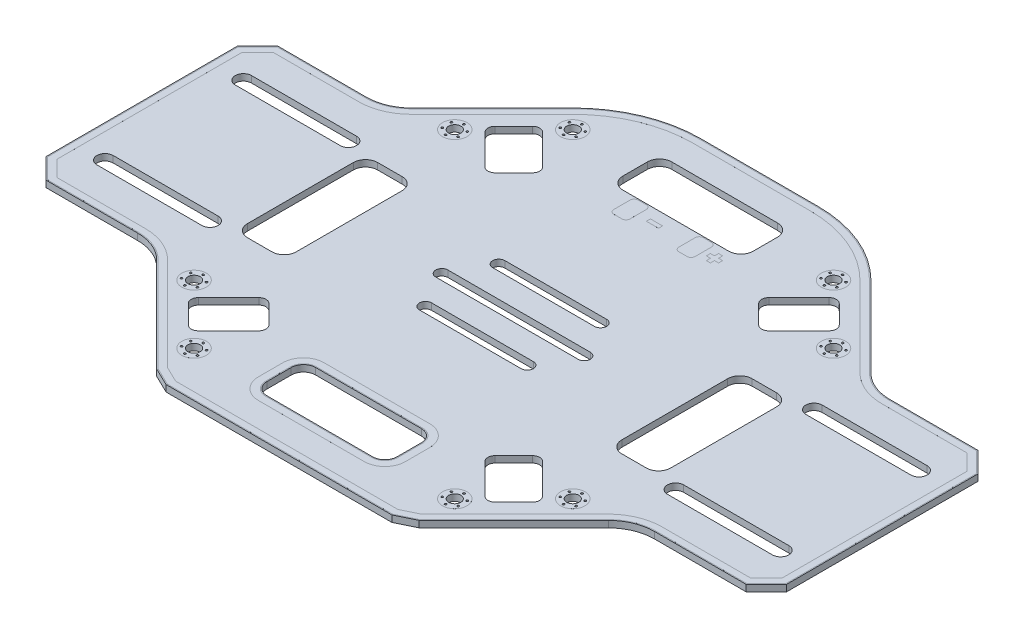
from build123d import *

# Parameters (mm, degrees)
BOSS_EXTRUDE1_DEPTH      = 0.8
BOSS_EXTRUDE1_DEPTH_BACK = 0.8
SKETCH1_R                = 1.5
SKETCH2_R                = 3
SKETCH2_R_2              = 0.25
SKETCH2_R_3              = 1.5
BOSS_EXTRUDE2_DEPTH      = 0.001
SKETCH6_R                = 0.25
CUT_EXTRUDE2_DEPTH       = 1.6
SKETCH7_W                = 3
SKETCH7_H                = 1
BOSS_EXTRUDE5_DEPTH      = 0.001


with BuildPart() as part:
    # Sketch1 → Boss-Extrude1 (new, two sides: drawn at the far end of the back side and taken through both)
    with BuildSketch(Plane(origin=(0, 0, 0), x_dir=(1, 0, 0), z_dir=(0, 1, 0)).offset(-BOSS_EXTRUDE1_DEPTH_BACK)):
        with BuildLine():
            Line((-27.75, -57.681401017), (27.75, -57.681401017))
            Line((27.75, -57.681401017), (32.25, -55.501951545))
            Line((32.25, -55.501951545), (55.501951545, -32.25))
            ThreePointArc((55.501951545, -32.25), (59.171487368, -29.798094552), (63.5, -28.937099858))
            Line((63.5, -28.937099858), (86, -28.937099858))
            Line((86, -28.937099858), (91, -23.937099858))
            Line((91, -23.937099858), (91, 23.062900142))
            Line((91, 23.062900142), (86, 28.062900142))
            Line((86, 28.062900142), (64.302117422, 28.062900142))
            ThreePointArc((64.302117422, 28.062900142), (60.040200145, 28.910648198), (56.427121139, 31.324830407))
            Line((56.427121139, 31.324830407), (36.628131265, 51.12382028))
            ThreePointArc((36.628131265, 51.12382028), (26.443529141, 57.928953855), (14.429971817, 60.318598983))
            Line((14.429971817, 60.318598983), (-14.429971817, 60.318598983))
            ThreePointArc((-14.429971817, 60.318598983), (-26.443529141, 57.928953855), (-36.628131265, 51.12382028))
            Line((-36.628131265, 51.12382028), (-56.427121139, 31.324830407))
            ThreePointArc((-56.427121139, 31.324830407), (-60.040200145, 28.910648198), (-64.302117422, 28.062900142))
            Line((-64.302117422, 28.062900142), (-86, 28.062900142))
            Line((-86, 28.062900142), (-91, 23.062900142))
            Line((-91, 23.062900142), (-91, -23.937099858))
            Line((-91, -23.937099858), (-86, -28.937099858))
            Line((-86, -28.937099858), (-63.5, -28.937099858))
            ThreePointArc((-63.5, -28.937099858), (-59.171487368, -29.798094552), (-55.501951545, -32.25))
            Line((-55.501951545, -32.25), (-32.25, -55.501951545))
            Line((-32.25, -55.501951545), (-27.75, -57.681401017))
        make_face()
        with Locations(Location((-32.031937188, 46.527626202, 0), (0, 0, 270))):
            Circle(SKETCH1_R, mode=Mode.SUBTRACT)
        with Locations(Location((-46.527626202, 32.031937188, 0), (0, 0, 270))):
            Circle(SKETCH1_R, mode=Mode.SUBTRACT)
        with Locations(Location((32.031937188, -46.527626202, 0), (0, 0, 270))):
            Circle(SKETCH1_R, mode=Mode.SUBTRACT)
        with Locations(Location((46.527626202, -32.031937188, 0), (0, 0, 270))):
            Circle(SKETCH1_R, mode=Mode.SUBTRACT)
        with Locations(Location((-46.527626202, -32.031937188, 0), (0, 0, 270))):
            Circle(SKETCH1_R, mode=Mode.SUBTRACT)
        with Locations(Location((-32.031937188, -46.527626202, 0), (0, 0, 270))):
            Circle(SKETCH1_R, mode=Mode.SUBTRACT)
        with Locations(Location((32.031937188, 46.527626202, 0), (0, 0, 270))):
            Circle(SKETCH1_R, mode=Mode.SUBTRACT)
        with Locations(Location((46.527626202, 32.031937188, 0), (0, 0, 270))):
            Circle(SKETCH1_R, mode=Mode.SUBTRACT)
        with BuildLine():
            Line((-13, -47.681401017), (13, -47.681401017))
            ThreePointArc((13, -47.681401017), (15.121320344, -46.802721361), (16, -44.681401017))
            Line((16, -44.681401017), (16, -38.681401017))
            ThreePointArc((16, -38.681401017), (15.121320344, -36.560080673), (13, -35.681401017))
            Line((13, -35.681401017), (-13, -35.681401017))
            ThreePointArc((-13, -35.681401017), (-15.121320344, -36.560080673), (-16, -38.681401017))
            Line((-16, -38.681401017), (-16, -44.681401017))
            ThreePointArc((-16, -44.681401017), (-15.121320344, -46.802721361), (-13, -47.681401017))
        make_face(mode=Mode.SUBTRACT)
        with BuildLine():
            Line((37.688791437, -42.284985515), (42.284985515, -37.688791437))
            ThreePointArc((42.284985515, -37.688791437), (42.797548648, -36.45135457), (42.284985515, -35.213917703))
            Line((42.284985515, -35.213917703), (34.860364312, -27.789296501))
            ThreePointArc((34.860364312, -27.789296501), (33.622927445, -27.276733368), (32.385490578, -27.789296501))
            Line((32.385490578, -27.789296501), (27.789296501, -32.385490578))
            ThreePointArc((27.789296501, -32.385490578), (27.276733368, -33.622927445), (27.789296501, -34.860364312))
            Line((27.789296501, -34.860364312), (35.213917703, -42.284985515))
            ThreePointArc((35.213917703, -42.284985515), (36.45135457, -42.797548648), (37.688791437, -42.284985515))
        make_face(mode=Mode.SUBTRACT)
        with BuildLine():
            Line((-35.213917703, -42.284985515), (-27.789296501, -34.860364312))
            ThreePointArc((-27.789296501, -34.860364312), (-27.276733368, -33.622927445), (-27.789296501, -32.385490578))
            Line((-27.789296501, -32.385490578), (-32.385490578, -27.789296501))
            ThreePointArc((-32.385490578, -27.789296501), (-33.622927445, -27.276733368), (-34.860364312, -27.789296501))
            Line((-34.860364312, -27.789296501), (-42.284985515, -35.213917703))
            ThreePointArc((-42.284985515, -35.213917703), (-42.797548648, -36.45135457), (-42.284985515, -37.688791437))
            Line((-42.284985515, -37.688791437), (-37.688791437, -42.284985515))
            ThreePointArc((-37.688791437, -42.284985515), (-36.45135457, -42.797548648), (-35.213917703, -42.284985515))
        make_face(mode=Mode.SUBTRACT)
        with BuildLine():
            Line((-35.213917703, 42.284985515), (-27.789296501, 34.860364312))
            ThreePointArc((-27.789296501, 34.860364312), (-27.276733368, 33.622927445), (-27.789296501, 32.385490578))
            Line((-27.789296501, 32.385490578), (-32.385490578, 27.789296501))
            ThreePointArc((-32.385490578, 27.789296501), (-33.622927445, 27.276733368), (-34.860364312, 27.789296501))
            Line((-34.860364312, 27.789296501), (-42.284985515, 35.213917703))
            ThreePointArc((-42.284985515, 35.213917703), (-42.797548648, 36.45135457), (-42.284985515, 37.688791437))
            Line((-42.284985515, 37.688791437), (-37.688791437, 42.284985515))
            ThreePointArc((-37.688791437, 42.284985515), (-36.45135457, 42.797548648), (-35.213917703, 42.284985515))
        make_face(mode=Mode.SUBTRACT)
        with BuildLine():
            Line((37.688791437, 42.284985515), (42.284985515, 37.688791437))
            ThreePointArc((42.284985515, 37.688791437), (42.797548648, 36.45135457), (42.284985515, 35.213917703))
            Line((42.284985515, 35.213917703), (34.860364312, 27.789296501))
            ThreePointArc((34.860364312, 27.789296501), (33.622927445, 27.276733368), (32.385490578, 27.789296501))
            Line((32.385490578, 27.789296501), (27.789296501, 32.385490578))
            ThreePointArc((27.789296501, 32.385490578), (27.276733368, 33.622927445), (27.789296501, 34.860364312))
            Line((27.789296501, 34.860364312), (35.213917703, 42.284985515))
            ThreePointArc((35.213917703, 42.284985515), (36.45135457, 42.797548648), (37.688791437, 42.284985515))
        make_face(mode=Mode.SUBTRACT)
        with BuildLine():
            Line((-13, 51.818598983), (13, 51.818598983))
            ThreePointArc((13, 51.818598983), (15.121320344, 50.939919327), (16, 48.818598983))
            Line((16, 48.818598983), (16, 42.818598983))
            ThreePointArc((16, 42.818598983), (15.121320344, 40.697278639), (13, 39.818598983))
            Line((13, 39.818598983), (-13, 39.818598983))
            ThreePointArc((-13, 39.818598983), (-15.121320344, 40.697278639), (-16, 42.818598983))
            Line((-16, 42.818598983), (-16, 48.818598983))
            ThreePointArc((-16, 48.818598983), (-15.121320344, 50.939919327), (-13, 51.818598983))
        make_face(mode=Mode.SUBTRACT)
        with BuildLine():
            Line((-12.5, -10.681401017), (12.5, -10.681401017))
            ThreePointArc((12.5, -10.681401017), (14, -9.181401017), (12.5, -7.681401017))
            Line((12.5, -7.681401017), (-12.5, -7.681401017))
            ThreePointArc((-12.5, -7.681401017), (-14, -9.181401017), (-12.5, -10.681401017))
        make_face(mode=Mode.SUBTRACT)
        with BuildLine():
            Line((-17.5, -1.681401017), (17.5, -1.681401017))
            ThreePointArc((17.5, -1.681401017), (19, -0.181401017), (17.5, 1.318598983))
            Line((17.5, 1.318598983), (-17.5, 1.318598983))
            ThreePointArc((-17.5, 1.318598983), (-19, -0.181401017), (-17.5, -1.681401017))
        make_face(mode=Mode.SUBTRACT)
        with BuildLine():
            Line((-12.5, 7.318598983), (12.5, 7.318598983))
            ThreePointArc((12.5, 7.318598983), (14, 8.818598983), (12.5, 10.318598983))
            Line((12.5, 10.318598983), (-12.5, 10.318598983))
            ThreePointArc((-12.5, 10.318598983), (-14, 8.818598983), (-12.5, 7.318598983))
        make_face(mode=Mode.SUBTRACT)
        with BuildLine():
            Line((-52, 12.562900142), (-52, -13.437099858))
            ThreePointArc((-52, -13.437099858), (-51.121320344, -15.558420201), (-49, -16.437099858))
            Line((-49, -16.437099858), (-43, -16.437099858))
            ThreePointArc((-43, -16.437099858), (-40.878679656, -15.558420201), (-40, -13.437099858))
            Line((-40, -13.437099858), (-40, 12.562900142))
            ThreePointArc((-40, 12.562900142), (-40.878679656, 14.684220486), (-43, 15.562900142))
            Line((-43, 15.562900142), (-49, 15.562900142))
            ThreePointArc((-49, 15.562900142), (-51.121320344, 14.684220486), (-52, 12.562900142))
        make_face(mode=Mode.SUBTRACT)
        with BuildLine():
            Line((52, 12.562900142), (52, -13.437099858))
            ThreePointArc((52, -13.437099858), (51.121320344, -15.558420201), (49, -16.437099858))
            Line((49, -16.437099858), (43, -16.437099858))
            ThreePointArc((43, -16.437099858), (40.878679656, -15.558420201), (40, -13.437099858))
            Line((40, -13.437099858), (40, 12.562900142))
            ThreePointArc((40, 12.562900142), (40.878679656, 14.684220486), (43, 15.562900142))
            Line((43, 15.562900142), (49, 15.562900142))
            ThreePointArc((49, 15.562900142), (51.121320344, 14.684220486), (52, 12.562900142))
        make_face(mode=Mode.SUBTRACT)
        with BuildLine():
            Line((-83, 18.562900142), (-57.2, 18.562900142))
            ThreePointArc((-57.2, 18.562900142), (-55.2, 16.562900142), (-57.2, 14.562900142))
            Line((-57.2, 14.562900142), (-83, 14.562900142))
            ThreePointArc((-83, 14.562900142), (-85, 16.562900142), (-83, 18.562900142))
        make_face(mode=Mode.SUBTRACT)
        with BuildLine():
            Line((-83, -15.437099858), (-57.2, -15.437099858))
            ThreePointArc((-57.2, -15.437099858), (-55.2, -17.437099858), (-57.2, -19.437099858))
            Line((-57.2, -19.437099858), (-83, -19.437099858))
            ThreePointArc((-83, -19.437099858), (-85, -17.437099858), (-83, -15.437099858))
        make_face(mode=Mode.SUBTRACT)
        with BuildLine():
            Line((57.2, -15.437099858), (83, -15.437099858))
            ThreePointArc((83, -15.437099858), (85, -17.437099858), (83, -19.437099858))
            Line((83, -19.437099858), (57.2, -19.437099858))
            ThreePointArc((57.2, -19.437099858), (55.2, -17.437099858), (57.2, -15.437099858))
        make_face(mode=Mode.SUBTRACT)
        with BuildLine():
            Line((57.2, 18.562900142), (83, 18.562900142))
            ThreePointArc((83, 18.562900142), (85, 16.562900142), (83, 14.562900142))
            Line((83, 14.562900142), (57.2, 14.562900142))
            ThreePointArc((57.2, 14.562900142), (55.2, 16.562900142), (57.2, 18.562900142))
        make_face(mode=Mode.SUBTRACT)
    extrude(amount=BOSS_EXTRUDE1_DEPTH + BOSS_EXTRUDE1_DEPTH_BACK)

    # Sketch2 → Boss-Extrude2 (add)
    # profile 1 of 10: a face of its own
    with BuildSketch(Plane(origin=(0, 0.8, 0), x_dir=(1, 0, 0), z_dir=(0, 1, 0))):
        with BuildLine():
            ThreePointArc((56.250344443, 31.148053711), (59.944529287, 28.679678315), (64.302117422, 27.812900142))
            Line((64.302117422, 27.812900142), (85.896446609, 27.812900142))
            Line((85.896446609, 27.812900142), (90.75, 22.959346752))
            Line((90.75, 22.959346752), (90.75, -23.833546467))
            Line((90.75, -23.833546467), (85.896446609, -28.687099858))
            Line((85.896446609, -28.687099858), (63.5, -28.687099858))
            ThreePointArc((63.5, -28.687099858), (59.075816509, -29.567124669), (55.32517485, -32.073223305))
            Line((55.32517485, -32.073223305), (32.10305631, -55.295341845))
            Line((32.10305631, -55.295341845), (27.692646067, -57.431401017))
            Line((27.692646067, -57.431401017), (-27.692646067, -57.431401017))
            Line((-27.692646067, -57.431401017), (-32.10305631, -55.295341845))
            Line((-32.10305631, -55.295341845), (-55.32517485, -32.073223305))
            ThreePointArc((-55.32517485, -32.073223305), (-59.075816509, -29.567124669), (-63.5, -28.687099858))
            Line((-63.5, -28.687099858), (-85.896446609, -28.687099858))
            Line((-85.896446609, -28.687099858), (-90.75, -23.833546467))
            Line((-90.75, -23.833546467), (-90.75, 22.959346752))
            Line((-90.75, 22.959346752), (-85.896446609, 27.812900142))
            Line((-85.896446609, 27.812900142), (-64.302117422, 27.812900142))
            ThreePointArc((-64.302117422, 27.812900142), (-59.944529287, 28.679678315), (-56.250344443, 31.148053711))
            Line((-56.250344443, 31.148053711), (-36.45135457, 50.947043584))
            ThreePointArc((-36.45135457, 50.947043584), (-26.347858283, 57.697983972), (-14.429971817, 60.068598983))
            Line((-14.429971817, 60.068598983), (14.429971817, 60.068598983))
            ThreePointArc((14.429971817, 60.068598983), (26.347858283, 57.697983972), (36.45135457, 50.947043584))
            Line((36.45135457, 50.947043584), (56.250344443, 31.148053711))
        make_face()
        with BuildLine():
            Line((-85.212994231, 26.162900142), (-64.302117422, 26.162900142))
            ThreePointArc((-64.302117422, 26.162900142), (-59.313101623, 27.155277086), (-55.083618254, 29.981327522))
            Line((-55.083618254, 29.981327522), (-35.284628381, 49.780317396))
            ThreePointArc((-35.284628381, 49.780317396), (-25.71643062, 56.173582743), (-14.429971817, 58.418598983))
            Line((-14.429971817, 58.418598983), (14.429971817, 58.418598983))
            ThreePointArc((14.429971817, 58.418598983), (25.71643062, 56.173582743), (35.284628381, 49.780317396))
            Line((35.284628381, 49.780317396), (55.083618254, 29.981327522))
            ThreePointArc((55.083618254, 29.981327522), (59.313101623, 27.155277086), (64.302117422, 26.162900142))
            Line((64.302117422, 26.162900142), (85.212994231, 26.162900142))
            Line((85.212994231, 26.162900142), (89.1, 22.275894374))
            Line((89.1, 22.275894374), (89.1, -23.150094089))
            Line((89.1, -23.150094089), (85.212994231, -27.037099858))
            Line((85.212994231, -27.037099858), (63.5, -27.037099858))
            ThreePointArc((63.5, -27.037099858), (58.444388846, -28.042723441), (54.158448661, -30.906497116))
            Line((54.158448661, -30.906497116), (31.133227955, -53.931717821))
            Line((31.133227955, -53.931717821), (27.314110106, -55.781401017))
            Line((27.314110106, -55.781401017), (-27.314110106, -55.781401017))
            Line((-27.314110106, -55.781401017), (-31.133227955, -53.931717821))
            Line((-31.133227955, -53.931717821), (-54.158448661, -30.906497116))
            ThreePointArc((-54.158448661, -30.906497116), (-58.444388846, -28.042723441), (-63.5, -27.037099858))
            Line((-63.5, -27.037099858), (-85.212994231, -27.037099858))
            Line((-85.212994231, -27.037099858), (-89.1, -23.150094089))
            Line((-89.1, -23.150094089), (-89.1, 22.275894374))
            Line((-89.1, 22.275894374), (-85.212994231, 26.162900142))
        make_face(mode=Mode.SUBTRACT)
    # profile 2 of 10: a face of its own
    with BuildSketch(Plane(origin=(0, 0.8, 0), x_dir=(1, 0, 0), z_dir=(0, 1, 0))):
        with Locations(Location((-32.031937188, -46.527626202, 0), (0, 0, 270))):
            Circle(SKETCH2_R)
        with Locations(Location((-33.980494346, -45.402626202, 0), (0, 0, 270))):
            Circle(SKETCH2_R_2, mode=Mode.SUBTRACT)
        with Locations(Location((-33.980494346, -47.652626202, 0), (0, 0, 270))):
            Circle(SKETCH2_R_2, mode=Mode.SUBTRACT)
        with Locations(Location((-32.031937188, -48.777626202, 0), (0, 0, 270))):
            Circle(SKETCH2_R_2, mode=Mode.SUBTRACT)
        with Locations(Location((-30.083380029, -47.652626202, 0), (0, 0, 270))):
            Circle(SKETCH2_R_2, mode=Mode.SUBTRACT)
        with Locations(Location((-30.083380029, -45.402626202, 0), (0, 0, 270))):
            Circle(SKETCH2_R_2, mode=Mode.SUBTRACT)
        with Locations(Location((-32.031937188, -44.277626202, 0), (0, 0, 270))):
            Circle(SKETCH2_R_2, mode=Mode.SUBTRACT)
        with Locations(Location((-32.031937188, -46.527626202, 0), (0, 0, 270))):
            Circle(SKETCH2_R_3, mode=Mode.SUBTRACT)
    # profile 3 of 10: a face of its own
    with BuildSketch(Plane(origin=(0, 0.8, 0), x_dir=(1, 0, 0), z_dir=(0, 1, 0))):
        with Locations(Location((-46.527626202, -32.031937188, 0), (0, 0, 270))):
            Circle(SKETCH2_R)
        with Locations(Location((-48.476183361, -30.906937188, 0), (0, 0, 270))):
            Circle(SKETCH2_R_2, mode=Mode.SUBTRACT)
        with Locations(Location((-48.476183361, -33.156937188, 0), (0, 0, 270))):
            Circle(SKETCH2_R_2, mode=Mode.SUBTRACT)
        with Locations(Location((-46.527626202, -34.281937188, 0), (0, 0, 270))):
            Circle(SKETCH2_R_2, mode=Mode.SUBTRACT)
        with Locations(Location((-44.579069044, -33.156937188, 0), (0, 0, 270))):
            Circle(SKETCH2_R_2, mode=Mode.SUBTRACT)
        with Locations(Location((-44.579069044, -30.906937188, 0), (0, 0, 270))):
            Circle(SKETCH2_R_2, mode=Mode.SUBTRACT)
        with Locations(Location((-46.527626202, -29.781937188, 0), (0, 0, 270))):
            Circle(SKETCH2_R_2, mode=Mode.SUBTRACT)
        with Locations(Location((-46.527626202, -32.031937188, 0), (0, 0, 270))):
            Circle(SKETCH2_R_3, mode=Mode.SUBTRACT)
    # profile 4 of 10: a face of its own
    with BuildSketch(Plane(origin=(0, 0.8, 0), x_dir=(1, 0, 0), z_dir=(0, 1, 0))):
        with Locations(Location((-46.527626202, 32.031937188, 0), (0, 0, 270))):
            Circle(SKETCH2_R)
        with Locations(Location((-48.476183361, 30.906937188, 0), (0, 0, 270))):
            Circle(SKETCH2_R_2, mode=Mode.SUBTRACT)
        with Locations(Location((-48.476183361, 33.156937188, 0), (0, 0, 270))):
            Circle(SKETCH2_R_2, mode=Mode.SUBTRACT)
        with Locations(Location((-46.527626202, 34.281937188, 0), (0, 0, 270))):
            Circle(SKETCH2_R_2, mode=Mode.SUBTRACT)
        with Locations(Location((-44.579069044, 33.156937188, 0), (0, 0, 270))):
            Circle(SKETCH2_R_2, mode=Mode.SUBTRACT)
        with Locations(Location((-44.579069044, 30.906937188, 0), (0, 0, 270))):
            Circle(SKETCH2_R_2, mode=Mode.SUBTRACT)
        with Locations(Location((-46.527626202, 29.781937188, 0), (0, 0, 270))):
            Circle(SKETCH2_R_2, mode=Mode.SUBTRACT)
        with Locations(Location((-46.527626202, 32.031937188, 0), (0, 0, 270))):
            Circle(SKETCH2_R_3, mode=Mode.SUBTRACT)
    # profile 5 of 10: a face of its own
    with BuildSketch(Plane(origin=(0, 0.8, 0), x_dir=(1, 0, 0), z_dir=(0, 1, 0))):
        with Locations(Location((-32.031937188, 46.527626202, 0), (0, 0, 270))):
            Circle(SKETCH2_R)
        with Locations(Location((-33.980494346, 45.402626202, 0), (0, 0, 270))):
            Circle(SKETCH2_R_2, mode=Mode.SUBTRACT)
        with Locations(Location((-33.980494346, 47.652626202, 0), (0, 0, 270))):
            Circle(SKETCH2_R_2, mode=Mode.SUBTRACT)
        with Locations(Location((-32.031937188, 44.277626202, 0), (0, 0, 270))):
            Circle(SKETCH2_R_2, mode=Mode.SUBTRACT)
        with Locations(Location((-30.083380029, 45.402626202, 0), (0, 0, 270))):
            Circle(SKETCH2_R_2, mode=Mode.SUBTRACT)
        with Locations(Location((-30.083380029, 47.652626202, 0), (0, 0, 270))):
            Circle(SKETCH2_R_2, mode=Mode.SUBTRACT)
        with Locations(Location((-32.031937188, 48.777626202, 0), (0, 0, 270))):
            Circle(SKETCH2_R_2, mode=Mode.SUBTRACT)
        with Locations(Location((-32.031937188, 46.527626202, 0), (0, 0, 270))):
            Circle(SKETCH2_R_3, mode=Mode.SUBTRACT)
    # profile 6 of 10: a face of its own
    with BuildSketch(Plane(origin=(0, 0.8, 0), x_dir=(1, 0, 0), z_dir=(0, 1, 0))):
        with Locations(Location((32.031937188, 46.527626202, 0), (0, 0, 270))):
            Circle(SKETCH2_R)
        with Locations(Location((30.083380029, 45.402626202, 0), (0, 0, 270))):
            Circle(SKETCH2_R_2, mode=Mode.SUBTRACT)
        with Locations(Location((30.083380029, 47.652626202, 0), (0, 0, 270))):
            Circle(SKETCH2_R_2, mode=Mode.SUBTRACT)
        with Locations(Location((32.031937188, 48.777626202, 0), (0, 0, 270))):
            Circle(SKETCH2_R_2, mode=Mode.SUBTRACT)
        with Locations(Location((33.980494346, 47.652626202, 0), (0, 0, 270))):
            Circle(SKETCH2_R_2, mode=Mode.SUBTRACT)
        with Locations(Location((33.980494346, 45.402626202, 0), (0, 0, 270))):
            Circle(SKETCH2_R_2, mode=Mode.SUBTRACT)
        with Locations(Location((32.031937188, 44.277626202, 0), (0, 0, 270))):
            Circle(SKETCH2_R_2, mode=Mode.SUBTRACT)
        with Locations(Location((32.031937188, 46.527626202, 0), (0, 0, 270))):
            Circle(SKETCH2_R_3, mode=Mode.SUBTRACT)
    # profile 7 of 10: a face of its own
    with BuildSketch(Plane(origin=(0, 0.8, 0), x_dir=(1, 0, 0), z_dir=(0, 1, 0))):
        with Locations(Location((46.527626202, 32.031937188, 0), (0, 0, 270))):
            Circle(SKETCH2_R)
        with Locations(Location((44.579069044, 30.906937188, 0), (0, 0, 270))):
            Circle(SKETCH2_R_2, mode=Mode.SUBTRACT)
        with Locations(Location((44.579069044, 33.156937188, 0), (0, 0, 270))):
            Circle(SKETCH2_R_2, mode=Mode.SUBTRACT)
        with Locations(Location((46.527626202, 34.281937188, 0), (0, 0, 270))):
            Circle(SKETCH2_R_2, mode=Mode.SUBTRACT)
        with Locations(Location((48.476183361, 33.156937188, 0), (0, 0, 270))):
            Circle(SKETCH2_R_2, mode=Mode.SUBTRACT)
        with Locations(Location((48.476183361, 30.906937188, 0), (0, 0, 270))):
            Circle(SKETCH2_R_2, mode=Mode.SUBTRACT)
        with Locations(Location((46.527626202, 29.781937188, 0), (0, 0, 270))):
            Circle(SKETCH2_R_2, mode=Mode.SUBTRACT)
        with Locations(Location((46.527626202, 32.031937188, 0), (0, 0, 270))):
            Circle(SKETCH2_R_3, mode=Mode.SUBTRACT)
    # profile 8 of 10: a face of its own
    with BuildSketch(Plane(origin=(0, 0.8, 0), x_dir=(1, 0, 0), z_dir=(0, 1, 0))):
        with Locations(Location((46.527626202, -32.031937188, 0), (0, 0, 270))):
            Circle(SKETCH2_R)
        with Locations(Location((44.579069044, -33.156937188, 0), (0, 0, 270))):
            Circle(SKETCH2_R_2, mode=Mode.SUBTRACT)
        with Locations(Location((44.579069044, -30.906937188, 0), (0, 0, 270))):
            Circle(SKETCH2_R_2, mode=Mode.SUBTRACT)
        with Locations(Location((46.527626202, -29.781937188, 0), (0, 0, 270))):
            Circle(SKETCH2_R_2, mode=Mode.SUBTRACT)
        with Locations(Location((48.476183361, -30.906937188, 0), (0, 0, 270))):
            Circle(SKETCH2_R_2, mode=Mode.SUBTRACT)
        with Locations(Location((48.476183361, -33.156937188, 0), (0, 0, 270))):
            Circle(SKETCH2_R_2, mode=Mode.SUBTRACT)
        with Locations(Location((46.527626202, -34.281937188, 0), (0, 0, 270))):
            Circle(SKETCH2_R_2, mode=Mode.SUBTRACT)
        with Locations(Location((46.527626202, -32.031937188, 0), (0, 0, 270))):
            Circle(SKETCH2_R_3, mode=Mode.SUBTRACT)
    # profile 9 of 10: a face of its own
    with BuildSketch(Plane(origin=(0, 0.8, 0), x_dir=(1, 0, 0), z_dir=(0, 1, 0))):
        with Locations(Location((32.031937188, -46.527626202, 0), (0, 0, 270))):
            Circle(SKETCH2_R)
        with Locations(Location((30.083380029, -45.402626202, 0), (0, 0, 270))):
            Circle(SKETCH2_R_2, mode=Mode.SUBTRACT)
        with Locations(Location((30.083380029, -47.652626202, 0), (0, 0, 270))):
            Circle(SKETCH2_R_2, mode=Mode.SUBTRACT)
        with Locations(Location((32.031937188, -48.777626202, 0), (0, 0, 270))):
            Circle(SKETCH2_R_2, mode=Mode.SUBTRACT)
        with Locations(Location((33.980494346, -47.652626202, 0), (0, 0, 270))):
            Circle(SKETCH2_R_2, mode=Mode.SUBTRACT)
        with Locations(Location((33.980494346, -45.402626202, 0), (0, 0, 270))):
            Circle(SKETCH2_R_2, mode=Mode.SUBTRACT)
        with Locations(Location((32.031937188, -44.277626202, 0), (0, 0, 270))):
            Circle(SKETCH2_R_2, mode=Mode.SUBTRACT)
        with Locations(Location((32.031937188, -46.527626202, 0), (0, 0, 270))):
            Circle(SKETCH2_R_3, mode=Mode.SUBTRACT)
    # profile 10 of 10: a face of its own
    with BuildSketch(Plane(origin=(0, 0.8, 0), x_dir=(1, 0, 0), z_dir=(0, 1, 0))):
        with BuildLine():
            Line((-13, -33.631401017), (13, -33.631401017))
            ThreePointArc((13, -33.631401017), (16.570889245, -35.110511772), (18.05, -38.681401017))
            Line((18.05, -38.681401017), (18.05, -44.681401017))
            ThreePointArc((18.05, -44.681401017), (16.570889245, -48.252290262), (13, -49.731401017))
            Line((13, -49.731401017), (-13, -49.731401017))
            ThreePointArc((-13, -49.731401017), (-16.570889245, -48.252290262), (-18.05, -44.681401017))
            Line((-18.05, -44.681401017), (-18.05, -38.681401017))
            ThreePointArc((-18.05, -38.681401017), (-16.570889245, -35.110511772), (-13, -33.631401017))
        make_face()
        with BuildLine():
            ThreePointArc((13, -47.931401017), (15.298097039, -46.979498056), (16.25, -44.681401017))
            Line((16.25, -44.681401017), (16.25, -38.681401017))
            ThreePointArc((16.25, -38.681401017), (15.298097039, -36.383303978), (13, -35.431401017))
            Line((13, -35.431401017), (-13, -35.431401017))
            ThreePointArc((-13, -35.431401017), (-15.298097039, -36.383303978), (-16.25, -38.681401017))
            Line((-16.25, -38.681401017), (-16.25, -44.681401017))
            ThreePointArc((-16.25, -44.681401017), (-15.298097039, -46.979498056), (-13, -47.931401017))
            Line((-13, -47.931401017), (13, -47.931401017))
        make_face(mode=Mode.SUBTRACT)
    boss_extrude2 = extrude(amount=BOSS_EXTRUDE2_DEPTH)

    # Mirror1: Boss-Extrude2 across plane
    add(boss_extrude2.mirror(Plane.ZX))

    # Sketch6 → Cut-Extrude2 (cut)
    with BuildSketch(Plane(origin=(0, 0.8, 0), x_dir=(1, 0, 0), z_dir=(0, 1, 0))):
        with Locations(Location((-48.476183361, 33.156937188, 0), (0, 0, 270))):
            Circle(SKETCH6_R)
        with Locations(Location((-46.527626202, 34.281937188, 0), (0, 0, 270))):
            Circle(SKETCH6_R)
        with Locations(Location((-44.579069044, 33.156937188, 0), (0, 0, 270))):
            Circle(SKETCH6_R)
        with Locations(Location((-48.476183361, 30.906937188, 0), (0, 0, 270))):
            Circle(SKETCH6_R)
        with Locations(Location((-46.527626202, 29.781937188, 0), (0, 0, 270))):
            Circle(SKETCH6_R)
        with Locations(Location((-44.579069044, 30.906937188, 0), (0, 0, 270))):
            Circle(SKETCH6_R)
        with Locations(Location((-33.980494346, 45.402626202, 0), (0, 0, 270))):
            Circle(SKETCH6_R)
        with Locations(Location((-32.031937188, 48.777626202, 0), (0, 0, 270))):
            Circle(SKETCH6_R)
        with Locations(Location((-33.980494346, 47.652626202, 0), (0, 0, 270))):
            Circle(SKETCH6_R)
        with Locations(Location((-32.031937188, 44.277626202, 0), (0, 0, 270))):
            Circle(SKETCH6_R)
        with Locations(Location((-30.083380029, 47.652626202, 0), (0, 0, 270))):
            Circle(SKETCH6_R)
        with Locations(Location((-30.083380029, 45.402626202, 0), (0, 0, 270))):
            Circle(SKETCH6_R)
        with Locations(Location((30.083380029, 47.652626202, 0), (0, 0, 270))):
            Circle(SKETCH6_R)
        with Locations(Location((32.031937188, 48.777626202, 0), (0, 0, 270))):
            Circle(SKETCH6_R)
        with Locations(Location((33.980494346, 47.652626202, 0), (0, 0, 270))):
            Circle(SKETCH6_R)
        with Locations(Location((33.980494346, 45.402626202, 0), (0, 0, 270))):
            Circle(SKETCH6_R)
        with Locations(Location((30.083380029, 45.402626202, 0), (0, 0, 270))):
            Circle(SKETCH6_R)
        with Locations(Location((32.031937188, 44.277626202, 0), (0, 0, 270))):
            Circle(SKETCH6_R)
        with Locations(Location((46.527626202, 34.281937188, 0), (0, 0, 270))):
            Circle(SKETCH6_R)
        with Locations(Location((48.476183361, 30.906937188, 0), (0, 0, 270))):
            Circle(SKETCH6_R)
        with Locations(Location((44.579069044, 33.156937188, 0), (0, 0, 270))):
            Circle(SKETCH6_R)
        with Locations(Location((48.476183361, 33.156937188, 0), (0, 0, 270))):
            Circle(SKETCH6_R)
        with Locations(Location((46.527626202, 29.781937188, 0), (0, 0, 270))):
            Circle(SKETCH6_R)
        with Locations(Location((44.579069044, 30.906937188, 0), (0, 0, 270))):
            Circle(SKETCH6_R)
        with Locations(Location((44.579069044, -30.906937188, 0), (0, 0, 270))):
            Circle(SKETCH6_R)
        with Locations(Location((46.527626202, -29.781937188, 0), (0, 0, 270))):
            Circle(SKETCH6_R)
        with Locations(Location((44.579069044, -33.156937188, 0), (0, 0, 270))):
            Circle(SKETCH6_R)
        with Locations(Location((48.476183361, -33.156937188, 0), (0, 0, 270))):
            Circle(SKETCH6_R)
        with Locations(Location((48.476183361, -30.906937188, 0), (0, 0, 270))):
            Circle(SKETCH6_R)
        with Locations(Location((46.527626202, -34.281937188, 0), (0, 0, 270))):
            Circle(SKETCH6_R)
        with Locations(Location((32.031937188, -44.277626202, 0), (0, 0, 270))):
            Circle(SKETCH6_R)
        with Locations(Location((30.083380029, -45.402626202, 0), (0, 0, 270))):
            Circle(SKETCH6_R)
        with Locations(Location((30.083380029, -47.652626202, 0), (0, 0, 270))):
            Circle(SKETCH6_R)
        with Locations(Location((33.980494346, -47.652626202, 0), (0, 0, 270))):
            Circle(SKETCH6_R)
        with Locations(Location((32.031937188, -48.777626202, 0), (0, 0, 270))):
            Circle(SKETCH6_R)
        with Locations(Location((33.980494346, -45.402626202, 0), (0, 0, 270))):
            Circle(SKETCH6_R)
        with Locations(Location((-48.476183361, -30.906937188, 0), (0, 0, 270))):
            Circle(SKETCH6_R)
        with Locations(Location((-44.579069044, -30.906937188, 0), (0, 0, 270))):
            Circle(SKETCH6_R)
        with Locations(Location((-48.476183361, -33.156937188, 0), (0, 0, 270))):
            Circle(SKETCH6_R)
        with Locations(Location((-46.527626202, -34.281937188, 0), (0, 0, 270))):
            Circle(SKETCH6_R)
        with Locations(Location((-44.579069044, -33.156937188, 0), (0, 0, 270))):
            Circle(SKETCH6_R)
        with Locations(Location((-46.527626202, -29.781937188, 0), (0, 0, 270))):
            Circle(SKETCH6_R)
        with Locations(Location((-33.980494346, -45.402626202, 0), (0, 0, 270))):
            Circle(SKETCH6_R)
        with Locations(Location((-32.031937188, -44.277626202, 0), (0, 0, 270))):
            Circle(SKETCH6_R)
        with Locations(Location((-30.083380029, -45.402626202, 0), (0, 0, 270))):
            Circle(SKETCH6_R)
        with Locations(Location((-30.083380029, -47.652626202, 0), (0, 0, 270))):
            Circle(SKETCH6_R)
        with Locations(Location((-33.980494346, -47.652626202, 0), (0, 0, 270))):
            Circle(SKETCH6_R)
        with Locations(Location((-32.031937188, -48.777626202, 0), (0, 0, 270))):
            Circle(SKETCH6_R)
    extrude(amount=-CUT_EXTRUDE2_DEPTH, mode=Mode.SUBTRACT)

    # Sketch7 → Boss-Extrude5 (add)
    with BuildSketch(Plane(origin=(0, 0.8, 0), x_dir=(1, 0, 0), z_dir=(0, 1, 0))):
        with BuildLine():
            Line((9, 39.568598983), (7, 39.568598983))
            ThreePointArc((7, 39.568598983), (6.292893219, 39.275705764), (6, 38.568598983))
            Line((6, 38.568598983), (6, 34.568598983))
            ThreePointArc((6, 34.568598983), (6.292893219, 33.861492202), (7, 33.568598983))
            Line((7, 33.568598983), (9, 33.568598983))
            ThreePointArc((9, 33.568598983), (9.707106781, 33.861492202), (10, 34.568598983))
            Line((10, 34.568598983), (10, 38.568598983))
            ThreePointArc((10, 38.568598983), (9.707106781, 39.275705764), (9, 39.568598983))
        make_face()
        with BuildLine():
            Line((-7, 39.568598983), (-9, 39.568598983))
            ThreePointArc((-9, 39.568598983), (-9.707106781, 39.275705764), (-10, 38.568598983))
            Line((-10, 38.568598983), (-10, 34.568598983))
            ThreePointArc((-10, 34.568598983), (-9.707106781, 33.861492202), (-9, 33.568598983))
            Line((-9, 33.568598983), (-7, 33.568598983))
            ThreePointArc((-7, 33.568598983), (-6.292893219, 33.861492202), (-6, 34.568598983))
            Line((-6, 34.568598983), (-6, 38.568598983))
            ThreePointArc((-6, 38.568598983), (-6.292893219, 39.275705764), (-7, 39.568598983))
        make_face()
        with Locations((-2, 36.568598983)):
            Rectangle(SKETCH7_W, SKETCH7_H)
        Polygon((14.25, 36.068598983), (13.25, 36.068598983), (13.25, 35.068598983), (12.25, 35.068598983), (12.25, 36.068598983), (11.25, 36.068598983), (11.25, 37.068598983), (12.25, 37.068598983), (12.25, 38.068598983), (13.25, 38.068598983), (13.25, 37.068598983), (14.25, 37.068598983), align=None)
    extrude(amount=BOSS_EXTRUDE5_DEPTH)


solid = part.part
